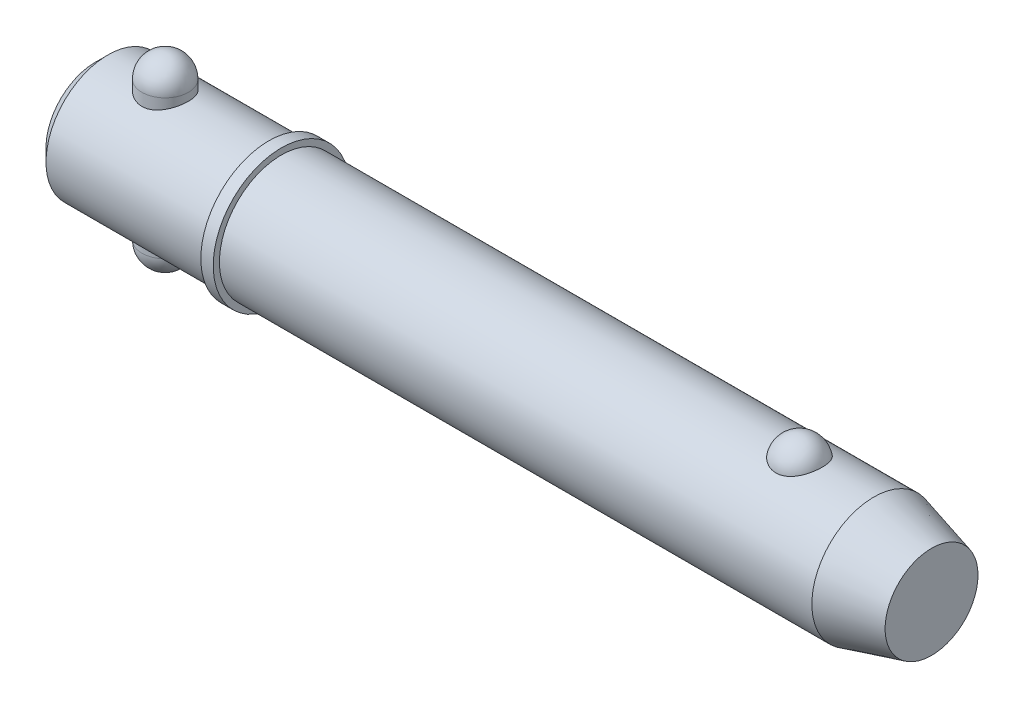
ISO-10303-21;
HEADER;
FILE_DESCRIPTION(('STEP AP214'),'2;1');
FILE_NAME('part.step','',(''),(''),'','','');
FILE_SCHEMA(('AUTOMOTIVE_DESIGN { 1 0 10303 214 1 1 1 1 }'));
ENDSEC;
DATA;
#1=APPLICATION_CONTEXT('core data for automotive mechanical design processes');
#2=APPLICATION_PROTOCOL_DEFINITION('international standard','automotive_design',2000,#1);
#3=PRODUCT_CONTEXT('',#1,'mechanical');
#4=PRODUCT('Part','Part','',(#3));
#5=PRODUCT_RELATED_PRODUCT_CATEGORY('part','',(#4));
#6=PRODUCT_DEFINITION_FORMATION('','',#4);
#7=PRODUCT_DEFINITION_CONTEXT('part definition',#1,'design');
#8=PRODUCT_DEFINITION('design','',#6,#7);
#9=PRODUCT_DEFINITION_SHAPE('','',#8);
#10=(LENGTH_UNIT() NAMED_UNIT(*) SI_UNIT(.MILLI.,.METRE.));
#11=(NAMED_UNIT(*) PLANE_ANGLE_UNIT() SI_UNIT($,.RADIAN.));
#12=(NAMED_UNIT(*) SI_UNIT($,.STERADIAN.) SOLID_ANGLE_UNIT());
#13=UNCERTAINTY_MEASURE_WITH_UNIT(LENGTH_MEASURE(1.E-05),#10,'distance_accuracy_value','');
#14=(GEOMETRIC_REPRESENTATION_CONTEXT(3) GLOBAL_UNCERTAINTY_ASSIGNED_CONTEXT((#13)) GLOBAL_UNIT_ASSIGNED_CONTEXT((#10,
#11,#12)) REPRESENTATION_CONTEXT('',''));
#15=CARTESIAN_POINT('',(0.,0.,0.));
#16=DIRECTION('',(0.,0.,1.));
#17=DIRECTION('',(1.,0.,0.));
#18=AXIS2_PLACEMENT_3D('',#15,#16,#17);
#19=CARTESIAN_POINT('',(14.28,19.05,0.));
#20=DIRECTION('',(0.,-1.,0.));
#21=DIRECTION('',(0.,0.,-1.));
#22=AXIS2_PLACEMENT_3D('',#19,#20,#21);
#23=CYLINDRICAL_SURFACE('',#22,4.76);
#24=CARTESIAN_POINT('',(14.28,-14.29,0.));
#25=DIRECTION('',(0.,-1.,0.));
#26=DIRECTION('',(0.,0.,-1.));
#27=AXIS2_PLACEMENT_3D('',#24,#25,#26);
#28=CIRCLE('',#27,4.76);
#29=CARTESIAN_POINT('',(14.28,-14.29,-4.76));
#30=VERTEX_POINT('',#29);
#31=EDGE_CURVE('P0_E10',#30,#30,#28,.F.);
#32=CARTESIAN_POINT('',(14.28,14.29,0.));
#33=DIRECTION('',(0.,-1.,0.));
#34=DIRECTION('',(0.,0.,-1.));
#35=AXIS2_PLACEMENT_3D('',#32,#33,#34);
#36=CIRCLE('',#35,4.76);
#37=CARTESIAN_POINT('',(14.28,14.29,-4.76));
#38=VERTEX_POINT('',#37);
#39=EDGE_CURVE('P0_E21',#38,#38,#36,.T.);
#40=CARTESIAN_POINT('',(14.28,-14.29,-4.76));
#41=CARTESIAN_POINT('',(14.28,-13.9922916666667,-4.76));
#42=CARTESIAN_POINT('',(14.28,-13.6945833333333,-4.76));
#43=CARTESIAN_POINT('',(14.28,-13.0991666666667,-4.76));
#44=CARTESIAN_POINT('',(14.28,-12.8014583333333,-4.76));
#45=CARTESIAN_POINT('',(14.28,-12.2060416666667,-4.76));
#46=CARTESIAN_POINT('',(14.28,-11.9083333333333,-4.76));
#47=CARTESIAN_POINT('',(14.28,-11.3129166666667,-4.76));
#48=CARTESIAN_POINT('',(14.28,-11.0152083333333,-4.76));
#49=CARTESIAN_POINT('',(14.28,-10.4197916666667,-4.76));
#50=CARTESIAN_POINT('',(14.28,-10.1220833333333,-4.76));
#51=CARTESIAN_POINT('',(14.28,-9.52666666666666,-4.76));
#52=CARTESIAN_POINT('',(14.28,-9.22895833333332,-4.76));
#53=CARTESIAN_POINT('',(14.28,-8.63354166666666,-4.76));
#54=CARTESIAN_POINT('',(14.28,-8.33583333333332,-4.76));
#55=CARTESIAN_POINT('',(14.28,-7.74041666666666,-4.76));
#56=CARTESIAN_POINT('',(14.28,-7.44270833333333,-4.76));
#57=CARTESIAN_POINT('',(14.28,-6.84729166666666,-4.76));
#58=CARTESIAN_POINT('',(14.28,-6.54958333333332,-4.76));
#59=CARTESIAN_POINT('',(14.28,-5.95416666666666,-4.76));
#60=CARTESIAN_POINT('',(14.28,-5.65645833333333,-4.76));
#61=CARTESIAN_POINT('',(14.28,-5.06104166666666,-4.76));
#62=CARTESIAN_POINT('',(14.28,-4.76333333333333,-4.76));
#63=CARTESIAN_POINT('',(14.28,-4.16791666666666,-4.76));
#64=CARTESIAN_POINT('',(14.28,-3.87020833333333,-4.76));
#65=CARTESIAN_POINT('',(14.28,-3.27479166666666,-4.76));
#66=CARTESIAN_POINT('',(14.28,-2.97708333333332,-4.76));
#67=CARTESIAN_POINT('',(14.28,-2.38166666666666,-4.76));
#68=CARTESIAN_POINT('',(14.28,-2.08395833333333,-4.76));
#69=CARTESIAN_POINT('',(14.28,-1.48854166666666,-4.76));
#70=CARTESIAN_POINT('',(14.28,-1.19083333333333,-4.76));
#71=CARTESIAN_POINT('',(14.28,-0.595416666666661,-4.76));
#72=CARTESIAN_POINT('',(14.28,-0.297708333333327,-4.76));
#73=CARTESIAN_POINT('',(14.28,0.297708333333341,-4.76));
#74=CARTESIAN_POINT('',(14.28,0.595416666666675,-4.76));
#75=CARTESIAN_POINT('',(14.28,1.19083333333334,-4.76));
#76=CARTESIAN_POINT('',(14.28,1.48854166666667,-4.76));
#77=CARTESIAN_POINT('',(14.28,2.08395833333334,-4.76));
#78=CARTESIAN_POINT('',(14.28,2.38166666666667,-4.76));
#79=CARTESIAN_POINT('',(14.28,2.97708333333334,-4.76));
#80=CARTESIAN_POINT('',(14.28,3.27479166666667,-4.76));
#81=CARTESIAN_POINT('',(14.28,3.87020833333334,-4.76));
#82=CARTESIAN_POINT('',(14.28,4.16791666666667,-4.76));
#83=CARTESIAN_POINT('',(14.28,4.76333333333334,-4.76));
#84=CARTESIAN_POINT('',(14.28,5.06104166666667,-4.76));
#85=CARTESIAN_POINT('',(14.28,5.65645833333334,-4.76));
#86=CARTESIAN_POINT('',(14.28,5.95416666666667,-4.76));
#87=CARTESIAN_POINT('',(14.28,6.54958333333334,-4.76));
#88=CARTESIAN_POINT('',(14.28,6.84729166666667,-4.76));
#89=CARTESIAN_POINT('',(14.28,7.44270833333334,-4.76));
#90=CARTESIAN_POINT('',(14.28,7.74041666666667,-4.76));
#91=CARTESIAN_POINT('',(14.28,8.33583333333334,-4.76));
#92=CARTESIAN_POINT('',(14.28,8.63354166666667,-4.76));
#93=CARTESIAN_POINT('',(14.28,9.22895833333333,-4.76));
#94=CARTESIAN_POINT('',(14.28,9.52666666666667,-4.76));
#95=CARTESIAN_POINT('',(14.28,10.1220833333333,-4.76));
#96=CARTESIAN_POINT('',(14.28,10.4197916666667,-4.76));
#97=CARTESIAN_POINT('',(14.28,11.0152083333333,-4.76));
#98=CARTESIAN_POINT('',(14.28,11.3129166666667,-4.76));
#99=CARTESIAN_POINT('',(14.28,11.9083333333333,-4.76));
#100=CARTESIAN_POINT('',(14.28,12.2060416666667,-4.76));
#101=CARTESIAN_POINT('',(14.28,12.8014583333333,-4.76));
#102=CARTESIAN_POINT('',(14.28,13.0991666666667,-4.76));
#103=CARTESIAN_POINT('',(14.28,13.6945833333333,-4.76));
#104=CARTESIAN_POINT('',(14.28,13.9922916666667,-4.76));
#105=CARTESIAN_POINT('',(14.28,14.29,-4.76));
#106=B_SPLINE_CURVE_WITH_KNOTS('',3,(#40,#41,#42,#43,#44,#45,#46,#47,#48,#49,#50,#51,#52,#53,
#54,#55,#56,#57,#58,#59,#60,#61,#62,#63,#64,#65,#66,#67,#68,#69,#70,#71,#72,#73,#74,#75,#76,#77,
#78,#79,#80,#81,#82,#83,#84,#85,#86,#87,#88,#89,#90,#91,#92,#93,#94,#95,#96,#97,#98,#99,#100,
#101,#102,#103,#104,#105),.UNSPECIFIED.,.F.,.F.,(4,2,2,2,2,2,2,2,2,2,2,2,2,2,2,2,2,2,2,2,2,2,2,
2,2,2,2,2,2,2,2,2,4),(0.,0.893125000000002,1.78625,2.67937499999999,3.5725,4.465625,5.35875,
6.25187499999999,7.145,8.038125,8.93125,9.82437499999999,10.7175,11.610625,12.50375,13.396875,
14.29,15.183125,16.07625,16.969375,17.8625,18.755625,19.64875,20.541875,21.435,22.328125,
23.22125,24.114375,25.0075,25.900625,26.79375,27.686875,28.58),.UNSPECIFIED.);
#107=EDGE_CURVE('P0_BSEAM14',#30,#38,#106,.T.);
#108=ORIENTED_EDGE('',*,*,#31,.T.);
#109=ORIENTED_EDGE('',*,*,#39,.T.);
#110=ORIENTED_EDGE('',*,*,#107,.T.);
#111=ORIENTED_EDGE('',*,*,#107,.F.);
#112=EDGE_LOOP('',(#108,#110,#109,#111));
#113=FACE_BOUND('',#112,.T.);
#114=ADVANCED_FACE('P0_F14',(#113),#23,.T.);
#115=CARTESIAN_POINT('',(14.28,-14.29,0.));
#116=DIRECTION('',(0.,0.,1.));
#117=DIRECTION('',(1.,0.,0.));
#118=AXIS2_PLACEMENT_3D('',#115,#116,#117);
#119=SPHERICAL_SURFACE('',#118,4.76);
#120=CARTESIAN_POINT('',(14.28,-14.29,0.));
#121=DIRECTION('',(0.,-1.,0.));
#122=DIRECTION('',(0.,0.,-1.));
#123=AXIS2_PLACEMENT_3D('',#120,#121,#122);
#124=SPHERICAL_SURFACE('',#123,4.76);
#125=ORIENTED_EDGE('',*,*,#31,.F.);
#126=EDGE_LOOP('',(#125));
#127=FACE_BOUND('',#126,.T.);
#128=ADVANCED_FACE('P0_F29',(#127),#124,.T.);
#129=CARTESIAN_POINT('',(14.28,14.29,0.));
#130=DIRECTION('',(0.,0.,1.));
#131=DIRECTION('',(1.,0.,0.));
#132=AXIS2_PLACEMENT_3D('',#129,#130,#131);
#133=SPHERICAL_SURFACE('',#132,4.76);
#134=CARTESIAN_POINT('',(14.28,14.29,0.));
#135=DIRECTION('',(0.,-1.,0.));
#136=DIRECTION('',(0.,0.,-1.));
#137=AXIS2_PLACEMENT_3D('',#134,#135,#136);
#138=SPHERICAL_SURFACE('',#137,4.76);
#139=ORIENTED_EDGE('',*,*,#39,.F.);
#140=EDGE_LOOP('',(#139));
#141=FACE_BOUND('',#140,.T.);
#142=ADVANCED_FACE('P0_F16',(#141),#138,.T.);
#143=CLOSED_SHELL('',(#114,#128,#142));
#144=MANIFOLD_SOLID_BREP('P0_B1',#143);
#145=CARTESIAN_POINT('',(0.,0.,0.));
#146=DIRECTION('',(1.,0.,0.));
#147=DIRECTION('',(0.,0.,-1.));
#148=AXIS2_PLACEMENT_3D('',#145,#146,#147);
#149=CYLINDRICAL_SURFACE('',#148,12.7);
#150=CARTESIAN_POINT('',(159.600738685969,0.,0.));
#151=DIRECTION('',(1.,0.,0.));
#152=DIRECTION('',(0.,0.,-1.));
#153=AXIS2_PLACEMENT_3D('',#150,#151,#152);
#154=CIRCLE('',#153,12.7);
#155=CARTESIAN_POINT('',(159.600738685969,0.,-12.7));
#156=VERTEX_POINT('',#155);
#157=EDGE_CURVE('P1_E81',#156,#156,#154,.T.);
#158=ORIENTED_EDGE('',*,*,#157,.F.);
#159=EDGE_LOOP('',(#158));
#160=FACE_BOUND('',#159,.T.);
#161=CARTESIAN_POINT('',(38.1,0.,0.));
#162=DIRECTION('',(1.,0.,0.));
#163=DIRECTION('',(0.,0.,-1.));
#164=AXIS2_PLACEMENT_3D('',#161,#162,#163);
#165=CIRCLE('',#164,12.7);
#166=CARTESIAN_POINT('',(38.1,0.,-12.7));
#167=VERTEX_POINT('',#166);
#168=EDGE_CURVE('P1_E85',#167,#167,#165,.T.);
#169=ORIENTED_EDGE('',*,*,#168,.T.);
#170=EDGE_LOOP('',(#169));
#171=FACE_BOUND('',#170,.T.);
#172=CARTESIAN_POINT('',(144.360042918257,11.7500437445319,4.81938502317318));
#173=CARTESIAN_POINT('',(144.235088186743,11.7500430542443,4.81938571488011));
#174=CARTESIAN_POINT('',(144.110144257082,11.7520975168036,4.81438658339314));
#175=CARTESIAN_POINT('',(143.861142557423,11.760253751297,4.79442904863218));
#176=CARTESIAN_POINT('',(143.737085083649,11.7663568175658,4.77946746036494));
#177=CARTESIAN_POINT('',(143.490901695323,11.7824262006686,4.73971414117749));
#178=CARTESIAN_POINT('',(143.368774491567,11.7923898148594,4.71492928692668));
#179=CARTESIAN_POINT('',(143.127187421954,11.8158938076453,4.65571340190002));
#180=CARTESIAN_POINT('',(143.00772859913,11.8294355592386,4.6212786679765));
#181=CARTESIAN_POINT('',(142.772557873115,11.8596812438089,4.54309502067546));
#182=CARTESIAN_POINT('',(142.656839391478,11.8763792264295,4.49936361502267));
#183=CARTESIAN_POINT('',(142.429653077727,11.9124878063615,4.40287235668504));
#184=CARTESIAN_POINT('',(142.318186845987,11.9318994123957,4.35010914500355));
#185=CARTESIAN_POINT('',(141.991278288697,11.9934256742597,4.17881316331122));
#186=CARTESIAN_POINT('',(141.783127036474,12.038858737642,4.04720756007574));
#187=CARTESIAN_POINT('',(141.385850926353,12.1352173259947,3.748564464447));
#188=CARTESIAN_POINT('',(141.197443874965,12.1862630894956,3.58061821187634));
#189=CARTESIAN_POINT('',(140.850521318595,12.2875163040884,3.21600758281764));
#190=CARTESIAN_POINT('',(140.692011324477,12.3377235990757,3.0193379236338));
#191=CARTESIAN_POINT('',(140.40168878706,12.4344923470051,2.592916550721));
#192=CARTESIAN_POINT('',(140.271376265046,12.4807925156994,2.36208286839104));
#193=CARTESIAN_POINT('',(140.049407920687,12.5623454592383,1.88070399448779));
#194=CARTESIAN_POINT('',(139.957755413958,12.5975972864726,1.63015711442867));
#195=CARTESIAN_POINT('',(139.814046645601,12.6538414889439,1.1129886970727));
#196=CARTESIAN_POINT('',(139.762499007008,12.6746503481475,0.846205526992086));
#197=CARTESIAN_POINT('',(139.701977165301,12.699153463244,0.307085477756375));
#198=CARTESIAN_POINT('',(139.693001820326,12.7028481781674,0.0347487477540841));
#199=CARTESIAN_POINT('',(139.717731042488,12.6927785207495,-0.506073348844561));
#200=CARTESIAN_POINT('',(139.751189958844,12.6791146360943,-0.774571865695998));
#201=CARTESIAN_POINT('',(139.859687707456,12.635882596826,-1.30170246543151));
#202=CARTESIAN_POINT('',(139.93472729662,12.606314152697,-1.56033436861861));
#203=CARTESIAN_POINT('',(140.12500006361,12.5342328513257,-2.06083899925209));
#204=CARTESIAN_POINT('',(140.240287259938,12.4917026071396,-2.30268867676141));
#205=CARTESIAN_POINT('',(140.508704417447,12.3981123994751,-2.76259600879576));
#206=CARTESIAN_POINT('',(140.661837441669,12.3470517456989,-2.98065173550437));
#207=CARTESIAN_POINT('',(141.003507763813,12.2416045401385,-3.38786328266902));
#208=CARTESIAN_POINT('',(141.192201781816,12.1872040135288,-3.57688418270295));
#209=CARTESIAN_POINT('',(141.600239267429,12.0814086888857,-3.91941073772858));
#210=CARTESIAN_POINT('',(141.819580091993,12.0300136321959,-4.07291945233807));
#211=CARTESIAN_POINT('',(142.278375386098,11.9373542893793,-4.33691289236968));
#212=CARTESIAN_POINT('',(142.517304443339,11.8958982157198,-4.44824125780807));
#213=CARTESIAN_POINT('',(143.01243761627,11.8268116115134,-4.62881985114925));
#214=CARTESIAN_POINT('',(143.268635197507,11.7991758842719,-4.69808589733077));
#215=CARTESIAN_POINT('',(143.777164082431,11.7622209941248,-4.78983181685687));
#216=CARTESIAN_POINT('',(144.029041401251,11.7520502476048,-4.81449025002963));
#217=CARTESIAN_POINT('',(144.533573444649,11.7485796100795,-4.82295735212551));
#218=CARTESIAN_POINT('',(144.786228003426,11.7552763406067,-4.80677420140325));
#219=CARTESIAN_POINT('',(145.276834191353,11.7842584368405,-4.73525430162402));
#220=CARTESIAN_POINT('',(145.514998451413,11.8060486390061,-4.68116061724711));
#221=CARTESIAN_POINT('',(145.978489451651,11.8622750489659,-4.53678133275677));
#222=CARTESIAN_POINT('',(146.203815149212,11.8967122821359,-4.44649279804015));
#223=CARTESIAN_POINT('',(146.640801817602,11.9754603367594,-4.22987613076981));
#224=CARTESIAN_POINT('',(146.852057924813,12.0199699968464,-4.10280539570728));
#225=CARTESIAN_POINT('',(147.250601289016,12.1138028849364,-3.81685409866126));
#226=CARTESIAN_POINT('',(147.437883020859,12.163127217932,-3.65796622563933));
#227=CARTESIAN_POINT('',(147.793350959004,12.2642343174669,-3.30364864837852));
#228=CARTESIAN_POINT('',(147.960111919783,12.3160165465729,-3.10678783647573));
#229=CARTESIAN_POINT('',(148.259579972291,12.4142566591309,-2.68748409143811));
#230=CARTESIAN_POINT('',(148.392280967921,12.4607135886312,-2.4650365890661));
#231=CARTESIAN_POINT('',(148.624691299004,12.5450236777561,-1.9928951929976));
#232=CARTESIAN_POINT('',(148.723215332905,12.5825557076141,-1.74255918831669));
#233=CARTESIAN_POINT('',(148.879227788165,12.6431720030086,-1.22773734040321));
#234=CARTESIAN_POINT('',(148.936715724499,12.6662560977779,-0.963251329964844));
#235=CARTESIAN_POINT('',(149.009544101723,12.6956486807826,-0.427355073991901));
#236=CARTESIAN_POINT('',(149.024837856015,12.7019385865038,-0.155937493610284));
#237=CARTESIAN_POINT('',(149.012779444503,12.6970201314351,0.385928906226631));
#238=CARTESIAN_POINT('',(148.98542805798,12.6858120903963,0.656377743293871));
#239=CARTESIAN_POINT('',(148.913060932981,12.6568455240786,1.05454017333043));
#240=CARTESIAN_POINT('',(148.883796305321,12.6451962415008,1.185778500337));
#241=CARTESIAN_POINT('',(148.815022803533,12.6181819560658,1.4451380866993));
#242=CARTESIAN_POINT('',(148.775517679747,12.6028183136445,1.57326046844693));
#243=CARTESIAN_POINT('',(148.686439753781,12.5687547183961,1.82554978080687));
#244=CARTESIAN_POINT('',(148.636862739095,12.5500533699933,1.9497150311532));
#245=CARTESIAN_POINT('',(148.52792115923,12.5098093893,2.19314370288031));
#246=CARTESIAN_POINT('',(148.468560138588,12.4882677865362,2.31240887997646));
#247=CARTESIAN_POINT('',(148.33997128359,12.4427679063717,2.54593031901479));
#248=CARTESIAN_POINT('',(148.270688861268,12.4187964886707,2.66015396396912));
#249=CARTESIAN_POINT('',(148.122903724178,12.3691892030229,2.88202659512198));
#250=CARTESIAN_POINT('',(148.044404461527,12.3435539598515,2.98967802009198));
#251=CARTESIAN_POINT('',(147.878550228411,12.2912955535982,3.19774385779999));
#252=CARTESIAN_POINT('',(147.791191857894,12.2646720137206,3.298155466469));
#253=CARTESIAN_POINT('',(147.608161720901,12.2111945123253,3.49095035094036));
#254=CARTESIAN_POINT('',(147.512493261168,12.1843406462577,3.58333679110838));
#255=CARTESIAN_POINT('',(147.313627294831,12.1312249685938,3.75922876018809));
#256=CARTESIAN_POINT('',(147.210450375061,12.104961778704,3.84275713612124));
#257=CARTESIAN_POINT('',(146.99701336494,12.0537284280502,4.00056406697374));
#258=CARTESIAN_POINT('',(146.886756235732,12.028757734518,4.07484645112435));
#259=CARTESIAN_POINT('',(146.659755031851,11.9808306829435,4.21367959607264));
#260=CARTESIAN_POINT('',(146.543006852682,11.9578756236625,4.27822410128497));
#261=CARTESIAN_POINT('',(146.30394258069,11.9147184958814,4.39698483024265));
#262=CARTESIAN_POINT('',(146.181628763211,11.894515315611,4.45120522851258));
#263=CARTESIAN_POINT('',(145.922952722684,11.8561129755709,4.55255353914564));
#264=CARTESIAN_POINT('',(145.786223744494,11.8381764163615,4.59884858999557));
#265=CARTESIAN_POINT('',(145.508608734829,11.8069093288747,4.67853897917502));
#266=CARTESIAN_POINT('',(145.367724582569,11.7935767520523,4.71194005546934));
#267=CARTESIAN_POINT('',(145.08309446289,11.7720277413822,4.76552188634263));
#268=CARTESIAN_POINT('',(144.939348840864,11.7638106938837,4.78570422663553));
#269=CARTESIAN_POINT('',(144.650411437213,11.7528195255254,4.81263433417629));
#270=CARTESIAN_POINT('',(144.505219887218,11.7500445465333,4.81938421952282));
#271=CARTESIAN_POINT('',(144.360042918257,11.7500437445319,4.81938502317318));
#272=B_SPLINE_CURVE_WITH_KNOTS('',3,(#172,#173,#174,#175,#176,#177,#178,#179,#180,#181,#182,
#183,#184,#185,#186,#187,#188,#189,#190,#191,#192,#193,#194,#195,#196,#197,#198,#199,#200,#201,
#202,#203,#204,#205,#206,#207,#208,#209,#210,#211,#212,#213,#214,#215,#216,#217,#218,#219,#220,
#221,#222,#223,#224,#225,#226,#227,#228,#229,#230,#231,#232,#233,#234,#235,#236,#237,#238,#239,
#240,#241,#242,#243,#244,#245,#246,#247,#248,#249,#250,#251,#252,#253,#254,#255,#256,#257,#258,
#259,#260,#261,#262,#263,#264,#265,#266,#267,#268,#269,#270,#271),.UNSPECIFIED.,.T.,.F.,(4,2,2,
2,2,2,2,2,2,2,2,2,2,2,2,2,2,2,2,2,2,2,2,2,2,2,2,2,2,2,2,2,2,2,2,2,2,2,2,2,2,2,2,2,2,2,2,2,2,4),
(0.,0.374729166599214,0.749578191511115,1.12416526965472,1.49889629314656,1.87292776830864,
2.24709865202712,2.99481328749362,3.76399449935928,4.53331735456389,5.3368391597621,
6.14042986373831,6.95405296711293,7.76765424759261,8.57656703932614,9.38549455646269,
10.1955119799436,11.0055949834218,11.8193353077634,12.6330054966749,13.4294141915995,
14.2255231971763,14.9815786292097,15.7374826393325,16.4696948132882,17.2019663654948,
17.9501979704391,18.6986017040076,19.4844704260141,20.2704797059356,21.0815215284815,
21.8925729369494,22.7045213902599,23.5164550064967,23.9209608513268,24.3253187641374,
24.7298461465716,25.1342272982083,25.54092555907,25.9474719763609,26.3541750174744,
26.7607169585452,27.1661834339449,27.5714814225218,27.9770386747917,28.3824315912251,
28.8181206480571,29.2536155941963,29.6890582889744,30.1244323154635),.UNSPECIFIED.);
#273=CARTESIAN_POINT('',(144.360042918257,11.7500437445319,4.81938502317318));
#274=VERTEX_POINT('',#273);
#275=EDGE_CURVE('P1_E35',#274,#274,#272,.T.);
#276=ORIENTED_EDGE('',*,*,#275,.T.);
#277=EDGE_LOOP('',(#276));
#278=FACE_BOUND('',#277,.T.);
#279=ADVANCED_FACE('P1_F13',(#160,#171,#278),#149,.T.);
#280=CARTESIAN_POINT('',(0.,0.,0.));
#281=DIRECTION('',(-1.,0.,0.));
#282=DIRECTION('',(0.,0.,1.));
#283=AXIS2_PLACEMENT_3D('',#280,#281,#282);
#284=PLANE('',#283);
#285=CARTESIAN_POINT('',(0.,0.,0.));
#286=DIRECTION('',(1.,0.,0.));
#287=DIRECTION('',(0.,0.,-1.));
#288=AXIS2_PLACEMENT_3D('',#285,#286,#287);
#289=CIRCLE('',#288,10.16);
#290=CARTESIAN_POINT('',(0.,0.,-10.16));
#291=VERTEX_POINT('',#290);
#292=EDGE_CURVE('P1_E9',#291,#291,#289,.T.);
#293=ORIENTED_EDGE('',*,*,#292,.F.);
#294=EDGE_LOOP('',(#293));
#295=FACE_BOUND('',#294,.T.);
#296=ADVANCED_FACE('P1_F15',(#295),#284,.T.);
#297=CARTESIAN_POINT('',(2.53999999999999,0.,0.));
#298=DIRECTION('',(1.,0.,0.));
#299=DIRECTION('',(0.,0.,-1.));
#300=AXIS2_PLACEMENT_3D('',#297,#298,#299);
#301=CONICAL_SURFACE('',#300,12.7,0.78539816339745);
#302=ORIENTED_EDGE('',*,*,#292,.T.);
#303=EDGE_LOOP('',(#302));
#304=FACE_BOUND('',#303,.T.);
#305=CARTESIAN_POINT('',(2.53999999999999,0.,0.));
#306=DIRECTION('',(1.,0.,0.));
#307=DIRECTION('',(0.,0.,-1.));
#308=AXIS2_PLACEMENT_3D('',#305,#306,#307);
#309=CIRCLE('',#308,12.7);
#310=CARTESIAN_POINT('',(2.53999999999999,0.,-12.7));
#311=VERTEX_POINT('',#310);
#312=EDGE_CURVE('P1_E26',#311,#311,#309,.T.);
#313=ORIENTED_EDGE('',*,*,#312,.F.);
#314=EDGE_LOOP('',(#313));
#315=FACE_BOUND('',#314,.T.);
#316=ADVANCED_FACE('P1_F77',(#304,#315),#301,.T.);
#317=CARTESIAN_POINT('',(0.,0.,0.));
#318=DIRECTION('',(1.,0.,0.));
#319=DIRECTION('',(0.,0.,-1.));
#320=AXIS2_PLACEMENT_3D('',#317,#318,#319);
#321=CYLINDRICAL_SURFACE('',#320,12.7);
#322=CARTESIAN_POINT('',(14.28,-11.7742260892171,4.76));
#323=CARTESIAN_POINT('',(14.1514948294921,-11.7742255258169,4.76000061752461));
#324=CARTESIAN_POINT('',(14.0229980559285,-11.7763355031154,4.75479194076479));
#325=CARTESIAN_POINT('',(13.7669369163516,-11.7847043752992,4.73401198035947));
#326=CARTESIAN_POINT('',(13.6393728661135,-11.7909646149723,4.71843733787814));
#327=CARTESIAN_POINT('',(13.386226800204,-11.8074248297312,4.67709434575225));
#328=CARTESIAN_POINT('',(13.2606439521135,-11.8176231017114,4.65133040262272));
#329=CARTESIAN_POINT('',(13.0122434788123,-11.8416347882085,4.58985545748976));
#330=CARTESIAN_POINT('',(12.8894269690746,-11.8554496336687,4.55414051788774));
#331=CARTESIAN_POINT('',(12.6477622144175,-11.8862222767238,4.47320764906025));
#332=CARTESIAN_POINT('',(12.5289037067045,-11.9031710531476,4.4280169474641));
#333=CARTESIAN_POINT('',(12.2955059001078,-11.939736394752,4.32845291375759));
#334=CARTESIAN_POINT('',(12.1809682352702,-11.9593539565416,4.2740761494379));
#335=CARTESIAN_POINT('',(11.8448901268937,-12.0213893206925,4.09777237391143));
#336=CARTESIAN_POINT('',(11.6307077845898,-12.0670135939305,3.9626122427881));
#337=CARTESIAN_POINT('',(11.2179129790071,-12.1641514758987,3.65386230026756));
#338=CARTESIAN_POINT('',(11.0204399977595,-12.2158379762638,3.47881300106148));
#339=CARTESIAN_POINT('',(10.6568212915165,-12.3178468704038,3.09829182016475));
#340=CARTESIAN_POINT('',(10.4906822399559,-12.3681689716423,2.89281347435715));
#341=CARTESIAN_POINT('',(10.1890299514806,-12.4638367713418,2.44867909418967));
#342=CARTESIAN_POINT('',(10.054749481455,-12.5089552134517,2.20913281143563));
#343=CARTESIAN_POINT('',(9.82886079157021,-12.5870472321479,1.70885919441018));
#344=CARTESIAN_POINT('',(9.73723778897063,-12.620025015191,1.44813923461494));
#345=CARTESIAN_POINT('',(9.60324488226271,-12.6688874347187,0.9248423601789));
#346=CARTESIAN_POINT('',(9.55892269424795,-12.6854474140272,0.662829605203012));
#347=CARTESIAN_POINT('',(9.5145335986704,-12.7020320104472,0.134596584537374));
#348=CARTESIAN_POINT('',(9.5144523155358,-12.7020619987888,-0.131622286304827));
#349=CARTESIAN_POINT('',(9.55741019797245,-12.6860129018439,-0.646717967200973));
#350=CARTESIAN_POINT('',(9.59831845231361,-12.6707298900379,-0.895801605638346));
#351=CARTESIAN_POINT('',(9.71850987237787,-12.6268158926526,-1.38327219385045));
#352=CARTESIAN_POINT('',(9.79779575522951,-12.5981839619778,-1.62165838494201));
#353=CARTESIAN_POINT('',(9.99348296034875,-12.5298894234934,-2.08508424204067));
#354=CARTESIAN_POINT('',(10.110407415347,-12.4900724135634,-2.30987931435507));
#355=CARTESIAN_POINT('',(10.3775896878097,-12.4034373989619,-2.7372158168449));
#356=CARTESIAN_POINT('',(10.5278582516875,-12.3566171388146,-2.93975004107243));
#357=CARTESIAN_POINT('',(10.8677318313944,-12.257571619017,-3.32936830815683));
#358=CARTESIAN_POINT('',(11.0591227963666,-12.2051903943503,-3.51485714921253));
#359=CARTESIAN_POINT('',(11.4706087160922,-12.1031155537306,-3.85170663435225));
#360=CARTESIAN_POINT('',(11.6907108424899,-12.0534226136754,-4.00305872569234));
#361=CARTESIAN_POINT('',(12.1596597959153,-11.9613684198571,-4.27038218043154));
#362=CARTESIAN_POINT('',(12.4090353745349,-11.9191939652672,-4.38549550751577));
#363=CARTESIAN_POINT('',(12.9256290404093,-11.8491124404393,-4.57149117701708));
#364=CARTESIAN_POINT('',(13.1928371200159,-11.8211974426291,-4.64239810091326));
#365=CARTESIAN_POINT('',(13.7217488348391,-11.7846654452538,-4.73434137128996));
#366=CARTESIAN_POINT('',(13.9829438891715,-11.7750694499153,-4.75791141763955));
#367=CARTESIAN_POINT('',(14.5056760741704,-11.7734909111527,-4.76182097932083));
#368=CARTESIAN_POINT('',(14.7672131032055,-11.7815039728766,-4.74217128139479));
#369=CARTESIAN_POINT('',(15.2702140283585,-11.8132466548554,-4.66249544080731));
#370=CARTESIAN_POINT('',(15.5120417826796,-11.8362133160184,-4.60442726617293));
#371=CARTESIAN_POINT('',(15.9824097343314,-11.8943704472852,-4.45202868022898));
#372=CARTESIAN_POINT('',(16.2109472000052,-11.9295634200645,-4.35769084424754));
#373=CARTESIAN_POINT('',(16.6577741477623,-12.0098310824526,-4.13144368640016));
#374=CARTESIAN_POINT('',(16.8753590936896,-12.055226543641,-3.99825937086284));
#375=CARTESIAN_POINT('',(17.2859732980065,-12.150238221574,-3.69949845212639));
#376=CARTESIAN_POINT('',(17.4789935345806,-12.19985597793,-3.5339100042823));
#377=CARTESIAN_POINT('',(17.8477707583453,-12.3015434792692,-3.1624728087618));
#378=CARTESIAN_POINT('',(18.0216609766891,-12.3535695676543,-2.95473880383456));
#379=CARTESIAN_POINT('',(18.254545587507,-12.426745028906,-2.62277433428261));
#380=CARTESIAN_POINT('',(18.3275489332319,-12.4503382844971,-2.50865480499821));
#381=CARTESIAN_POINT('',(18.463723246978,-12.4952713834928,-2.27428971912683));
#382=CARTESIAN_POINT('',(18.5268984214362,-12.5166121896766,-2.15404681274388));
#383=CARTESIAN_POINT('',(18.6427140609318,-12.5563817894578,-1.90858448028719));
#384=CARTESIAN_POINT('',(18.6953855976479,-12.5748191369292,-1.78338108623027));
#385=CARTESIAN_POINT('',(18.7899337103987,-12.6083284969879,-1.52857834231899));
#386=CARTESIAN_POINT('',(18.8318147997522,-12.6234019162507,-1.39898085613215));
#387=CARTESIAN_POINT('',(18.9043819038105,-12.6497495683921,-1.13633254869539));
#388=CARTESIAN_POINT('',(18.9350698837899,-12.6610244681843,-1.00328233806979));
#389=CARTESIAN_POINT('',(18.9849303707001,-12.6794412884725,-0.734761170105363));
#390=CARTESIAN_POINT('',(19.0041035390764,-12.6865834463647,-0.59929035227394));
#391=CARTESIAN_POINT('',(19.0299427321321,-12.6962286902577,-0.335006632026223));
#392=CARTESIAN_POINT('',(19.0372742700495,-12.698978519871,-0.206267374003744));
#393=CARTESIAN_POINT('',(19.0414668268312,-12.7005496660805,0.0514515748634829));
#394=CARTESIAN_POINT('',(19.038324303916,-12.69936965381,0.180431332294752));
#395=CARTESIAN_POINT('',(19.0215965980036,-12.6931114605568,0.437551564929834));
#396=CARTESIAN_POINT('',(19.0080165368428,-12.6880351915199,0.565692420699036));
#397=CARTESIAN_POINT('',(18.9705519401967,-12.6741222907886,0.820297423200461));
#398=CARTESIAN_POINT('',(18.9466635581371,-12.665284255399,0.946760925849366));
#399=CARTESIAN_POINT('',(18.8895279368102,-12.6443449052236,1.19395899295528));
#400=CARTESIAN_POINT('',(18.8565273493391,-12.6323299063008,1.3147578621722));
#401=CARTESIAN_POINT('',(18.781239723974,-12.6052503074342,1.55308888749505));
#402=CARTESIAN_POINT('',(18.738949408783,-12.5901846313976,1.67061987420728));
#403=CARTESIAN_POINT('',(18.5986461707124,-12.5409473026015,2.01714406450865));
#404=CARTESIAN_POINT('',(18.4871532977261,-12.502717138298,2.24027279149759));
#405=CARTESIAN_POINT('',(18.2262440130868,-12.4173042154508,2.6742599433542));
#406=CARTESIAN_POINT('',(18.0754310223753,-12.3698127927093,2.88420891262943));
#407=CARTESIAN_POINT('',(17.7421836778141,-12.271667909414,3.27675114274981));
#408=CARTESIAN_POINT('',(17.5597380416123,-12.2210133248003,3.45933459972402));
#409=CARTESIAN_POINT('',(17.2605468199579,-12.1452079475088,3.7138066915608));
#410=CARTESIAN_POINT('',(17.1535518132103,-12.119328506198,3.79719993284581));
#411=CARTESIAN_POINT('',(16.9326449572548,-12.0688597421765,3.95467398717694));
#412=CARTESIAN_POINT('',(16.8187356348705,-12.0442699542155,4.02875817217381));
#413=CARTESIAN_POINT('',(16.5846234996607,-11.9971053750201,4.16711104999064));
#414=CARTESIAN_POINT('',(16.4644172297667,-11.9745317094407,4.23137427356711));
#415=CARTESIAN_POINT('',(16.2185866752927,-11.9321360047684,4.34949041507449));
#416=CARTESIAN_POINT('',(16.09296473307,-11.9123127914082,4.40334777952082));
#417=CARTESIAN_POINT('',(15.8314769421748,-11.875268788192,4.50232278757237));
#418=CARTESIAN_POINT('',(15.6954035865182,-11.8582009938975,4.54695127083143));
#419=CARTESIAN_POINT('',(15.4194002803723,-11.8284328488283,4.62383807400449));
#420=CARTESIAN_POINT('',(15.2794720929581,-11.815730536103,4.6561019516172));
#421=CARTESIAN_POINT('',(14.9969657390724,-11.7951940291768,4.70788444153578));
#422=CARTESIAN_POINT('',(14.8543884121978,-11.7873583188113,4.72740702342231));
#423=CARTESIAN_POINT('',(14.5678704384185,-11.7768749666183,4.75346370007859));
#424=CARTESIAN_POINT('',(14.4239299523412,-11.7742267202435,4.75999930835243));
#425=CARTESIAN_POINT('',(14.28,-11.7742260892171,4.76));
#426=B_SPLINE_CURVE_WITH_KNOTS('',3,(#322,#323,#324,#325,#326,#327,#328,#329,#330,#331,#332,
#333,#334,#335,#336,#337,#338,#339,#340,#341,#342,#343,#344,#345,#346,#347,#348,#349,#350,#351,
#352,#353,#354,#355,#356,#357,#358,#359,#360,#361,#362,#363,#364,#365,#366,#367,#368,#369,#370,
#371,#372,#373,#374,#375,#376,#377,#378,#379,#380,#381,#382,#383,#384,#385,#386,#387,#388,#389,
#390,#391,#392,#393,#394,#395,#396,#397,#398,#399,#400,#401,#402,#403,#404,#405,#406,#407,#408,
#409,#410,#411,#412,#413,#414,#415,#416,#417,#418,#419,#420,#421,#422,#423,#424,#425),
.UNSPECIFIED.,.T.,.F.,(4,2,2,2,2,2,2,2,2,2,2,2,2,2,2,2,2,2,2,2,2,2,2,2,2,2,2,2,2,2,2,2,2,2,2,2,
2,2,2,2,2,2,2,2,2,2,2,2,2,2,2,4),(0.,0.385378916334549,0.770882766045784,1.15622008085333,
1.54171009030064,1.92610725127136,2.31064835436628,3.07917291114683,3.88239385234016,
4.68578566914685,5.51648193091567,6.34689010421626,7.14151420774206,7.93588010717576,
8.69098665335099,9.44614666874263,10.2122918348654,10.9786842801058,11.789876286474,
12.6012713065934,13.4306405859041,14.2595482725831,15.0427613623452,15.8257790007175,
16.5716820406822,17.3177378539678,18.0917395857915,18.8660247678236,19.6893332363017,
20.1014571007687,20.5134040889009,20.9241137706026,21.3346513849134,21.7451168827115,
22.1555587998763,22.542011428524,22.928594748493,23.3149884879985,23.7015265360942,
24.0784835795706,24.4555738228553,25.2091300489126,25.994347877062,26.7798463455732,
27.1937428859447,27.6074890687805,28.0214648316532,28.4352633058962,28.8672794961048,
29.299101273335,29.7307884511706,30.1624253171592),.UNSPECIFIED.);
#427=CARTESIAN_POINT('',(14.28,-11.7742260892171,4.76));
#428=VERTEX_POINT('',#427);
#429=EDGE_CURVE('P1_E17',#428,#428,#426,.T.);
#430=ORIENTED_EDGE('',*,*,#429,.F.);
#431=EDGE_LOOP('',(#430));
#432=FACE_BOUND('',#431,.T.);
#433=CARTESIAN_POINT('',(14.28,11.7742260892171,4.76));
#434=CARTESIAN_POINT('',(14.4085051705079,11.7742255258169,4.76000061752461));
#435=CARTESIAN_POINT('',(14.5370019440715,11.7763355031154,4.75479194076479));
#436=CARTESIAN_POINT('',(14.7930630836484,11.7847043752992,4.73401198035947));
#437=CARTESIAN_POINT('',(14.9206271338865,11.7909646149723,4.71843733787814));
#438=CARTESIAN_POINT('',(15.173773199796,11.8074248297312,4.67709434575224));
#439=CARTESIAN_POINT('',(15.2993560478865,11.8176231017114,4.65133040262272));
#440=CARTESIAN_POINT('',(15.5477565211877,11.8416347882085,4.58985545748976));
#441=CARTESIAN_POINT('',(15.6705730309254,11.8554496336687,4.55414051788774));
#442=CARTESIAN_POINT('',(15.9122377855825,11.8862222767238,4.47320764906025));
#443=CARTESIAN_POINT('',(16.0310962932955,11.9031710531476,4.4280169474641));
#444=CARTESIAN_POINT('',(16.2644940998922,11.939736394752,4.32845291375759));
#445=CARTESIAN_POINT('',(16.3790317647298,11.9593539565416,4.2740761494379));
#446=CARTESIAN_POINT('',(16.7151098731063,12.0213893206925,4.09777237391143));
#447=CARTESIAN_POINT('',(16.9292922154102,12.0670135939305,3.96261224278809));
#448=CARTESIAN_POINT('',(17.3420870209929,12.1641514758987,3.65386230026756));
#449=CARTESIAN_POINT('',(17.5395600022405,12.2158379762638,3.47881300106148));
#450=CARTESIAN_POINT('',(17.9031787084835,12.3178468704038,3.09829182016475));
#451=CARTESIAN_POINT('',(18.0693177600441,12.3681689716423,2.89281347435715));
#452=CARTESIAN_POINT('',(18.3709700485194,12.4638367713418,2.44867909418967));
#453=CARTESIAN_POINT('',(18.505250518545,12.5089552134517,2.20913281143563));
#454=CARTESIAN_POINT('',(18.7311392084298,12.5870472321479,1.70885919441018));
#455=CARTESIAN_POINT('',(18.8227622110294,12.620025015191,1.44813923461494));
#456=CARTESIAN_POINT('',(18.9567551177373,12.6688874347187,0.924842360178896));
#457=CARTESIAN_POINT('',(19.0010773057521,12.6854474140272,0.662829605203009));
#458=CARTESIAN_POINT('',(19.0454664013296,12.7020320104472,0.134596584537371));
#459=CARTESIAN_POINT('',(19.0455476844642,12.7020619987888,-0.13162228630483));
#460=CARTESIAN_POINT('',(19.0025898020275,12.6860129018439,-0.646717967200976));
#461=CARTESIAN_POINT('',(18.9616815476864,12.6707298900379,-0.89580160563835));
#462=CARTESIAN_POINT('',(18.8414901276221,12.6268158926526,-1.38327219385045));
#463=CARTESIAN_POINT('',(18.7622042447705,12.5981839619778,-1.62165838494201));
#464=CARTESIAN_POINT('',(18.5665170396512,12.5298894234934,-2.08508424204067));
#465=CARTESIAN_POINT('',(18.449592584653,12.4900724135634,-2.30987931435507));
#466=CARTESIAN_POINT('',(18.1824103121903,12.4034373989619,-2.7372158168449));
#467=CARTESIAN_POINT('',(18.0321417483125,12.3566171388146,-2.93975004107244));
#468=CARTESIAN_POINT('',(17.6922681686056,12.257571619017,-3.32936830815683));
#469=CARTESIAN_POINT('',(17.5008772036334,12.2051903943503,-3.51485714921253));
#470=CARTESIAN_POINT('',(17.0893912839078,12.1031155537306,-3.85170663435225));
#471=CARTESIAN_POINT('',(16.8692891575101,12.0534226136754,-4.00305872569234));
#472=CARTESIAN_POINT('',(16.4003402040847,11.9613684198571,-4.27038218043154));
#473=CARTESIAN_POINT('',(16.1509646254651,11.9191939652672,-4.38549550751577));
#474=CARTESIAN_POINT('',(15.6343709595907,11.8491124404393,-4.57149117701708));
#475=CARTESIAN_POINT('',(15.367162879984,11.8211974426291,-4.64239810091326));
#476=CARTESIAN_POINT('',(14.8382511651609,11.7846654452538,-4.73434137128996));
#477=CARTESIAN_POINT('',(14.5770561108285,11.7750694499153,-4.75791141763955));
#478=CARTESIAN_POINT('',(14.0543239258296,11.7734909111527,-4.76182097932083));
#479=CARTESIAN_POINT('',(13.7927868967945,11.7815039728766,-4.74217128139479));
#480=CARTESIAN_POINT('',(13.2897859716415,11.8132466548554,-4.66249544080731));
#481=CARTESIAN_POINT('',(13.0479582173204,11.8362133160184,-4.60442726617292));
#482=CARTESIAN_POINT('',(12.5775902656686,11.8943704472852,-4.45202868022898));
#483=CARTESIAN_POINT('',(12.3490527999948,11.9295634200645,-4.35769084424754));
#484=CARTESIAN_POINT('',(11.9022258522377,12.0098310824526,-4.13144368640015));
#485=CARTESIAN_POINT('',(11.6846409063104,12.055226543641,-3.99825937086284));
#486=CARTESIAN_POINT('',(11.2740267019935,12.150238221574,-3.69949845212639));
#487=CARTESIAN_POINT('',(11.0810064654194,12.19985597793,-3.5339100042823));
#488=CARTESIAN_POINT('',(10.7122292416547,12.3015434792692,-3.1624728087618));
#489=CARTESIAN_POINT('',(10.5383390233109,12.3535695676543,-2.95473880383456));
#490=CARTESIAN_POINT('',(10.305454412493,12.426745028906,-2.6227743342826));
#491=CARTESIAN_POINT('',(10.2324510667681,12.4503382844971,-2.50865480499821));
#492=CARTESIAN_POINT('',(10.096276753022,12.4952713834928,-2.27428971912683));
#493=CARTESIAN_POINT('',(10.0331015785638,12.5166121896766,-2.15404681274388));
#494=CARTESIAN_POINT('',(9.91728593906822,12.5563817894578,-1.90858448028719));
#495=CARTESIAN_POINT('',(9.8646144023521,12.5748191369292,-1.78338108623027));
#496=CARTESIAN_POINT('',(9.77006628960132,12.6083284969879,-1.52857834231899));
#497=CARTESIAN_POINT('',(9.72818520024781,12.6234019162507,-1.39898085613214));
#498=CARTESIAN_POINT('',(9.65561809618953,12.6497495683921,-1.13633254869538));
#499=CARTESIAN_POINT('',(9.62493011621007,12.6610244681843,-1.00328233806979));
#500=CARTESIAN_POINT('',(9.57506962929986,12.6794412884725,-0.734761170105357));
#501=CARTESIAN_POINT('',(9.55589646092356,12.6865834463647,-0.599290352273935));
#502=CARTESIAN_POINT('',(9.53005726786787,12.6962286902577,-0.335006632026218));
#503=CARTESIAN_POINT('',(9.52272572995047,12.698978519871,-0.20626737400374));
#504=CARTESIAN_POINT('',(9.51853317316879,12.7005496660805,0.0514515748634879));
#505=CARTESIAN_POINT('',(9.52167569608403,12.69936965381,0.180431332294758));
#506=CARTESIAN_POINT('',(9.53840340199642,12.6931114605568,0.43755156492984));
#507=CARTESIAN_POINT('',(9.55198346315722,12.6880351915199,0.565692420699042));
#508=CARTESIAN_POINT('',(9.58944805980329,12.6741222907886,0.820297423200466));
#509=CARTESIAN_POINT('',(9.61333644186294,12.665284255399,0.946760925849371));
#510=CARTESIAN_POINT('',(9.67047206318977,12.6443449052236,1.19395899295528));
#511=CARTESIAN_POINT('',(9.7034726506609,12.6323299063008,1.31475786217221));
#512=CARTESIAN_POINT('',(9.77876027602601,12.6052503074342,1.55308888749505));
#513=CARTESIAN_POINT('',(9.82105059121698,12.5901846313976,1.67061987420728));
#514=CARTESIAN_POINT('',(9.96135382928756,12.5409473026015,2.01714406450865));
#515=CARTESIAN_POINT('',(10.0728467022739,12.502717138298,2.24027279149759));
#516=CARTESIAN_POINT('',(10.3337559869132,12.4173042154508,2.6742599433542));
#517=CARTESIAN_POINT('',(10.4845689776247,12.3698127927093,2.88420891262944));
#518=CARTESIAN_POINT('',(10.8178163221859,12.271667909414,3.27675114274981));
#519=CARTESIAN_POINT('',(11.0002619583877,12.2210133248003,3.45933459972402));
#520=CARTESIAN_POINT('',(11.2994531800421,12.1452079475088,3.7138066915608));
#521=CARTESIAN_POINT('',(11.4064481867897,12.119328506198,3.79719993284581));
#522=CARTESIAN_POINT('',(11.6273550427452,12.0688597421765,3.95467398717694));
#523=CARTESIAN_POINT('',(11.7412643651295,12.0442699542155,4.02875817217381));
#524=CARTESIAN_POINT('',(11.9753765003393,11.9971053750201,4.16711104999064));
#525=CARTESIAN_POINT('',(12.0955827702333,11.9745317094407,4.23137427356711));
#526=CARTESIAN_POINT('',(12.3414133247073,11.9321360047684,4.34949041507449));
#527=CARTESIAN_POINT('',(12.46703526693,11.9123127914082,4.40334777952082));
#528=CARTESIAN_POINT('',(12.7285230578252,11.875268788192,4.50232278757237));
#529=CARTESIAN_POINT('',(12.8645964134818,11.8582009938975,4.54695127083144));
#530=CARTESIAN_POINT('',(13.1405997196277,11.8284328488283,4.62383807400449));
#531=CARTESIAN_POINT('',(13.2805279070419,11.815730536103,4.6561019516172));
#532=CARTESIAN_POINT('',(13.5630342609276,11.7951940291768,4.70788444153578));
#533=CARTESIAN_POINT('',(13.7056115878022,11.7873583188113,4.72740702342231));
#534=CARTESIAN_POINT('',(13.9921295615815,11.7768749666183,4.75346370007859));
#535=CARTESIAN_POINT('',(14.1360700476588,11.7742267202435,4.75999930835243));
#536=CARTESIAN_POINT('',(14.28,11.7742260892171,4.76));
#537=B_SPLINE_CURVE_WITH_KNOTS('',3,(#433,#434,#435,#436,#437,#438,#439,#440,#441,#442,#443,
#444,#445,#446,#447,#448,#449,#450,#451,#452,#453,#454,#455,#456,#457,#458,#459,#460,#461,#462,
#463,#464,#465,#466,#467,#468,#469,#470,#471,#472,#473,#474,#475,#476,#477,#478,#479,#480,#481,
#482,#483,#484,#485,#486,#487,#488,#489,#490,#491,#492,#493,#494,#495,#496,#497,#498,#499,#500,
#501,#502,#503,#504,#505,#506,#507,#508,#509,#510,#511,#512,#513,#514,#515,#516,#517,#518,#519,
#520,#521,#522,#523,#524,#525,#526,#527,#528,#529,#530,#531,#532,#533,#534,#535,#536),
.UNSPECIFIED.,.T.,.F.,(4,2,2,2,2,2,2,2,2,2,2,2,2,2,2,2,2,2,2,2,2,2,2,2,2,2,2,2,2,2,2,2,2,2,2,2,
2,2,2,2,2,2,2,2,2,2,2,2,2,2,2,4),(0.,0.385378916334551,0.770882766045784,1.15622008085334,
1.54171009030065,1.92610725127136,2.31064835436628,3.07917291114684,3.88239385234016,
4.68578566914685,5.51648193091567,6.34689010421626,7.14151420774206,7.93588010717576,
8.690986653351,9.44614666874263,10.2122918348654,10.9786842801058,11.789876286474,
12.6012713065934,13.4306405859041,14.2595482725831,15.0427613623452,15.8257790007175,
16.5716820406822,17.3177378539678,18.0917395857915,18.8660247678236,19.6893332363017,
20.1014571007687,20.5134040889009,20.9241137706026,21.3346513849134,21.7451168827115,
22.1555587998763,22.542011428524,22.928594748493,23.3149884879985,23.7015265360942,
24.0784835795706,24.4555738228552,25.2091300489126,25.994347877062,26.7798463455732,
27.1937428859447,27.6074890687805,28.0214648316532,28.4352633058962,28.8672794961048,
29.299101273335,29.7307884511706,30.1624253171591),.UNSPECIFIED.);
#538=CARTESIAN_POINT('',(14.28,11.7742260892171,4.76));
#539=VERTEX_POINT('',#538);
#540=EDGE_CURVE('P1_E43',#539,#539,#537,.T.);
#541=ORIENTED_EDGE('',*,*,#540,.F.);
#542=EDGE_LOOP('',(#541));
#543=FACE_BOUND('',#542,.T.);
#544=ORIENTED_EDGE('',*,*,#312,.T.);
#545=EDGE_LOOP('',(#544));
#546=FACE_BOUND('',#545,.T.);
#547=CARTESIAN_POINT('',(35.56,0.,0.));
#548=DIRECTION('',(1.,0.,0.));
#549=DIRECTION('',(0.,0.,-1.));
#550=AXIS2_PLACEMENT_3D('',#547,#548,#549);
#551=CIRCLE('',#550,12.7);
#552=CARTESIAN_POINT('',(35.56,0.,-12.7));
#553=VERTEX_POINT('',#552);
#554=EDGE_CURVE('P1_E31',#553,#553,#551,.T.);
#555=ORIENTED_EDGE('',*,*,#554,.F.);
#556=EDGE_LOOP('',(#555));
#557=FACE_BOUND('',#556,.T.);
#558=ADVANCED_FACE('P1_F103',(#432,#543,#546,#557),#321,.T.);
#559=CARTESIAN_POINT('',(35.56,12.7,0.));
#560=DIRECTION('',(-1.,0.,0.));
#561=DIRECTION('',(0.,0.,1.));
#562=AXIS2_PLACEMENT_3D('',#559,#560,#561);
#563=PLANE('',#562);
#564=ORIENTED_EDGE('',*,*,#554,.T.);
#565=EDGE_LOOP('',(#564));
#566=FACE_BOUND('',#565,.T.);
#567=CARTESIAN_POINT('',(35.56,0.,0.));
#568=DIRECTION('',(1.,0.,0.));
#569=DIRECTION('',(0.,0.,-1.));
#570=AXIS2_PLACEMENT_3D('',#567,#568,#569);
#571=CIRCLE('',#570,13.97);
#572=CARTESIAN_POINT('',(35.56,0.,-13.97));
#573=VERTEX_POINT('',#572);
#574=EDGE_CURVE('P1_E91',#573,#573,#571,.T.);
#575=ORIENTED_EDGE('',*,*,#574,.F.);
#576=EDGE_LOOP('',(#575));
#577=FACE_BOUND('',#576,.T.);
#578=ADVANCED_FACE('P1_F100',(#566,#577),#563,.T.);
#579=CARTESIAN_POINT('',(0.,0.,0.));
#580=DIRECTION('',(1.,0.,0.));
#581=DIRECTION('',(0.,0.,-1.));
#582=AXIS2_PLACEMENT_3D('',#579,#580,#581);
#583=CYLINDRICAL_SURFACE('',#582,13.97);
#584=ORIENTED_EDGE('',*,*,#574,.T.);
#585=EDGE_LOOP('',(#584));
#586=FACE_BOUND('',#585,.T.);
#587=CARTESIAN_POINT('',(38.1,0.,0.));
#588=DIRECTION('',(1.,0.,0.));
#589=DIRECTION('',(0.,0.,-1.));
#590=AXIS2_PLACEMENT_3D('',#587,#588,#589);
#591=CIRCLE('',#590,13.97);
#592=CARTESIAN_POINT('',(38.1,0.,-13.97));
#593=VERTEX_POINT('',#592);
#594=EDGE_CURVE('P1_E88',#593,#593,#591,.T.);
#595=ORIENTED_EDGE('',*,*,#594,.F.);
#596=EDGE_LOOP('',(#595));
#597=FACE_BOUND('',#596,.T.);
#598=ADVANCED_FACE('P1_F68',(#586,#597),#583,.T.);
#599=CARTESIAN_POINT('',(38.1,13.97,0.));
#600=DIRECTION('',(1.,0.,0.));
#601=DIRECTION('',(0.,0.,-1.));
#602=AXIS2_PLACEMENT_3D('',#599,#600,#601);
#603=PLANE('',#602);
#604=ORIENTED_EDGE('',*,*,#594,.T.);
#605=EDGE_LOOP('',(#604));
#606=FACE_BOUND('',#605,.T.);
#607=ORIENTED_EDGE('',*,*,#168,.F.);
#608=EDGE_LOOP('',(#607));
#609=FACE_BOUND('',#608,.T.);
#610=ADVANCED_FACE('P1_F62',(#606,#609),#603,.T.);
#611=CARTESIAN_POINT('',(171.45,0.,0.));
#612=DIRECTION('',(-1.,0.,0.));
#613=DIRECTION('',(0.,0.,1.));
#614=AXIS2_PLACEMENT_3D('',#611,#612,#613);
#615=CONICAL_SURFACE('',#614,9.52500000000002,0.26179938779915);
#616=ORIENTED_EDGE('',*,*,#157,.T.);
#617=EDGE_LOOP('',(#616));
#618=FACE_BOUND('',#617,.T.);
#619=CARTESIAN_POINT('',(171.45,0.,0.));
#620=DIRECTION('',(1.,0.,0.));
#621=DIRECTION('',(0.,0.,-1.));
#622=AXIS2_PLACEMENT_3D('',#619,#620,#621);
#623=CIRCLE('',#622,9.52500000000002);
#624=CARTESIAN_POINT('',(171.45,0.,-9.52500000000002));
#625=VERTEX_POINT('',#624);
#626=EDGE_CURVE('P1_E42',#625,#625,#623,.T.);
#627=ORIENTED_EDGE('',*,*,#626,.F.);
#628=EDGE_LOOP('',(#627));
#629=FACE_BOUND('',#628,.T.);
#630=ADVANCED_FACE('P1_F59',(#618,#629),#615,.T.);
#631=CARTESIAN_POINT('',(171.45,9.52500000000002,0.));
#632=DIRECTION('',(1.,0.,0.));
#633=DIRECTION('',(0.,0.,-1.));
#634=AXIS2_PLACEMENT_3D('',#631,#632,#633);
#635=PLANE('',#634);
#636=ORIENTED_EDGE('',*,*,#626,.T.);
#637=EDGE_LOOP('',(#636));
#638=FACE_BOUND('',#637,.T.);
#639=ADVANCED_FACE('P1_F55',(#638),#635,.T.);
#640=CARTESIAN_POINT('',(144.360042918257,11.43,0.));
#641=DIRECTION('',(-1.,0.,0.));
#642=DIRECTION('',(0.,1.,0.));
#643=AXIS2_PLACEMENT_3D('',#640,#641,#642);
#644=SPHERICAL_SURFACE('',#643,4.83);
#645=ORIENTED_EDGE('',*,*,#275,.F.);
#646=EDGE_LOOP('',(#645));
#647=FACE_BOUND('',#646,.T.);
#648=ADVANCED_FACE('P1_F50',(#647),#644,.T.);
#649=CARTESIAN_POINT('',(14.28,-13.97,0.));
#650=DIRECTION('',(0.,1.,0.));
#651=DIRECTION('',(0.,0.,1.));
#652=AXIS2_PLACEMENT_3D('',#649,#650,#651);
#653=CYLINDRICAL_SURFACE('',#652,4.76);
#654=ORIENTED_EDGE('',*,*,#429,.T.);
#655=EDGE_LOOP('',(#654));
#656=FACE_BOUND('',#655,.T.);
#657=ORIENTED_EDGE('',*,*,#540,.T.);
#658=EDGE_LOOP('',(#657));
#659=FACE_BOUND('',#658,.T.);
#660=ADVANCED_FACE('P1_F54',(#656,#659),#653,.F.);
#661=CLOSED_SHELL('',(#279,#296,#316,#558,#578,#598,#610,#630,#639,#648,#660));
#662=MANIFOLD_SOLID_BREP('P1_B1',#661);
#663=ADVANCED_BREP_SHAPE_REPRESENTATION('',(#18,#144,#662),#14);
#664=SHAPE_DEFINITION_REPRESENTATION(#9,#663);
ENDSEC;
END-ISO-10303-21;
